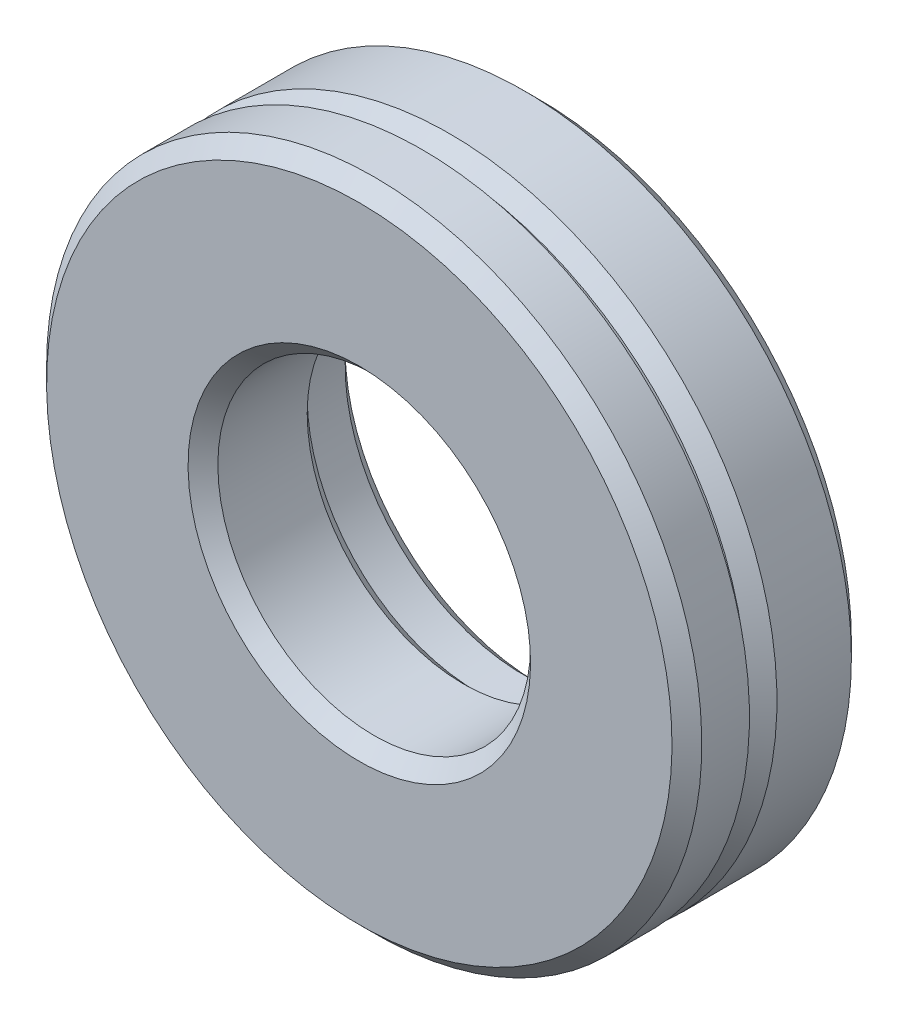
ISO-10303-21;
HEADER;
FILE_DESCRIPTION(('STEP AP214'),'2;1');
FILE_NAME('part.step','',(''),(''),'','','');
FILE_SCHEMA(('AUTOMOTIVE_DESIGN { 1 0 10303 214 1 1 1 1 }'));
ENDSEC;
DATA;
#1=APPLICATION_CONTEXT('core data for automotive mechanical design processes');
#2=APPLICATION_PROTOCOL_DEFINITION('international standard','automotive_design',2000,#1);
#3=PRODUCT_CONTEXT('',#1,'mechanical');
#4=PRODUCT('Part','Part','',(#3));
#5=PRODUCT_RELATED_PRODUCT_CATEGORY('part','',(#4));
#6=PRODUCT_DEFINITION_FORMATION('','',#4);
#7=PRODUCT_DEFINITION_CONTEXT('part definition',#1,'design');
#8=PRODUCT_DEFINITION('design','',#6,#7);
#9=PRODUCT_DEFINITION_SHAPE('','',#8);
#10=(LENGTH_UNIT() NAMED_UNIT(*) SI_UNIT(.MILLI.,.METRE.));
#11=(NAMED_UNIT(*) PLANE_ANGLE_UNIT() SI_UNIT($,.RADIAN.));
#12=(NAMED_UNIT(*) SI_UNIT($,.STERADIAN.) SOLID_ANGLE_UNIT());
#13=UNCERTAINTY_MEASURE_WITH_UNIT(LENGTH_MEASURE(1.E-05),#10,'distance_accuracy_value','');
#14=(GEOMETRIC_REPRESENTATION_CONTEXT(3) GLOBAL_UNCERTAINTY_ASSIGNED_CONTEXT((#13)) GLOBAL_UNIT_ASSIGNED_CONTEXT((#10,
#11,#12)) REPRESENTATION_CONTEXT('',''));
#15=CARTESIAN_POINT('',(0.,0.,0.));
#16=DIRECTION('',(0.,0.,1.));
#17=DIRECTION('',(1.,0.,0.));
#18=AXIS2_PLACEMENT_3D('',#15,#16,#17);
#19=CARTESIAN_POINT('',(0.,0.,0.));
#20=DIRECTION('',(0.,0.,1.));
#21=DIRECTION('',(1.,0.,0.));
#22=AXIS2_PLACEMENT_3D('',#19,#20,#21);
#23=CYLINDRICAL_SURFACE('',#22,8.61199182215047);
#24=CARTESIAN_POINT('',(0.,0.,2.90390499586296));
#25=DIRECTION('',(0.,0.,1.));
#26=DIRECTION('',(1.,0.,0.));
#27=AXIS2_PLACEMENT_3D('',#24,#25,#26);
#28=CIRCLE('',#27,8.61199182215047);
#29=CARTESIAN_POINT('',(-8.61199182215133,8.86610527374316E-13,2.90390499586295));
#30=VERTEX_POINT('',#29);
#31=EDGE_CURVE('E19',#30,#30,#28,.F.);
#32=ORIENTED_EDGE('',*,*,#31,.T.);
#33=EDGE_LOOP('',(#32));
#34=FACE_BOUND('',#33,.T.);
#35=CARTESIAN_POINT('',(0.,0.,2.90381377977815));
#36=DIRECTION('',(0.,0.,1.));
#37=DIRECTION('',(1.,0.,0.));
#38=AXIS2_PLACEMENT_3D('',#35,#36,#37);
#39=CIRCLE('',#38,8.61199182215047);
#40=CARTESIAN_POINT('',(8.61199182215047,0.,2.90381377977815));
#41=VERTEX_POINT('',#40);
#42=EDGE_CURVE('E62',#41,#41,#39,.T.);
#43=ORIENTED_EDGE('',*,*,#42,.T.);
#44=EDGE_LOOP('',(#43));
#45=FACE_BOUND('',#44,.T.);
#46=ADVANCED_FACE('F12',(#34,#45),#23,.T.);
#47=CARTESIAN_POINT('',(0.,0.,0.));
#48=DIRECTION('',(0.,0.,1.));
#49=DIRECTION('',(1.,0.,0.));
#50=AXIS2_PLACEMENT_3D('',#47,#48,#49);
#51=CYLINDRICAL_SURFACE('',#50,6.59430380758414);
#52=CARTESIAN_POINT('',(0.,0.,2.25912402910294));
#53=DIRECTION('',(0.,0.,1.));
#54=DIRECTION('',(1.,0.,0.));
#55=AXIS2_PLACEMENT_3D('',#52,#53,#54);
#56=CIRCLE('',#55,6.59430380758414);
#57=CARTESIAN_POINT('',(-6.59430380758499,8.86610527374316E-13,2.25912402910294));
#58=VERTEX_POINT('',#57);
#59=EDGE_CURVE('E32',#58,#58,#56,.F.);
#60=ORIENTED_EDGE('',*,*,#59,.F.);
#61=EDGE_LOOP('',(#60));
#62=FACE_BOUND('',#61,.T.);
#63=CARTESIAN_POINT('',(0.,0.,2.16943540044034));
#64=DIRECTION('',(0.,0.,1.));
#65=DIRECTION('',(1.,0.,0.));
#66=AXIS2_PLACEMENT_3D('',#63,#64,#65);
#67=CIRCLE('',#66,6.59430380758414);
#68=CARTESIAN_POINT('',(6.59430380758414,0.,2.16943540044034));
#69=VERTEX_POINT('',#68);
#70=EDGE_CURVE('E8',#69,#69,#67,.T.);
#71=ORIENTED_EDGE('',*,*,#70,.F.);
#72=EDGE_LOOP('',(#71));
#73=FACE_BOUND('',#72,.T.);
#74=ADVANCED_FACE('F58',(#62,#73),#51,.F.);
#75=CARTESIAN_POINT('',(-9.05098420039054E-13,8.86610527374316E-13,26.3737494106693));
#76=DIRECTION('',(0.,0.,-1.));
#77=DIRECTION('',(-1.,0.,0.));
#78=AXIS2_PLACEMENT_3D('',#75,#76,#77);
#79=SPHERICAL_SURFACE('',#78,25.);
#80=CARTESIAN_POINT('',(-9.05098420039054E-13,8.86610527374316E-13,2.04013105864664));
#81=DIRECTION('',(0.,0.,1.));
#82=DIRECTION('',(0.,1.,0.));
#83=AXIS2_PLACEMENT_3D('',#80,#81,#82);
#84=CIRCLE('',#83,5.73367403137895);
#85=CARTESIAN_POINT('',(-5.73367403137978,8.86610527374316E-13,2.04013105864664));
#86=VERTEX_POINT('',#85);
#87=EDGE_CURVE('E43',#86,#86,#84,.F.);
#88=CARTESIAN_POINT('',(-5.73367403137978,8.86610527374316E-13,2.04013105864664));
#89=CARTESIAN_POINT('',(-5.74267850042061,8.86610527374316E-13,2.04225276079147));
#90=CARTESIAN_POINT('',(-5.75168179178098,8.86610527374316E-13,2.04437946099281));
#91=CARTESIAN_POINT('',(-5.76968600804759,8.86610527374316E-13,2.04864285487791));
#92=CARTESIAN_POINT('',(-5.77868693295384,8.86610527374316E-13,2.05077954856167));
#93=CARTESIAN_POINT('',(-5.79668640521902,8.86610527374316E-13,2.05506292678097));
#94=CARTESIAN_POINT('',(-5.80568495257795,8.86610527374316E-13,2.05720961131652));
#95=CARTESIAN_POINT('',(-5.82367965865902,8.86610527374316E-13,2.06151296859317));
#96=CARTESIAN_POINT('',(-5.83267581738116,8.86610527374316E-13,2.06366964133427));
#97=CARTESIAN_POINT('',(-5.85066573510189,8.86610527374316E-13,2.06799297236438));
#98=CARTESIAN_POINT('',(-5.85965949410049,8.86610527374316E-13,2.07015963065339));
#99=CARTESIAN_POINT('',(-5.8776446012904,8.86610527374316E-13,2.0745029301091));
#100=CARTESIAN_POINT('',(-5.88663594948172,8.86610527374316E-13,2.0766795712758));
#101=CARTESIAN_POINT('',(-5.9046162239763,8.86610527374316E-13,2.08104283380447));
#102=CARTESIAN_POINT('',(-5.91360515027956,8.86610527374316E-13,2.08322945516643));
#103=CARTESIAN_POINT('',(-5.93158056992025,8.86610527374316E-13,2.08761267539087));
#104=CARTESIAN_POINT('',(-5.94056706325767,8.86610527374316E-13,2.08980927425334));
#105=CARTESIAN_POINT('',(-5.95853760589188,8.86610527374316E-13,2.09421244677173));
#106=CARTESIAN_POINT('',(-5.96752165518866,8.86610527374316E-13,2.09641902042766));
#107=CARTESIAN_POINT('',(-5.98548729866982,8.86610527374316E-13,2.10084213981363));
#108=CARTESIAN_POINT('',(-5.9944688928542,8.86610527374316E-13,2.10305868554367));
#109=CARTESIAN_POINT('',(-6.01242961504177,8.86610527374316E-13,2.10750174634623));
#110=CARTESIAN_POINT('',(-6.02140874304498,8.86610527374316E-13,2.10972826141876));
#111=CARTESIAN_POINT('',(-6.0393645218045,8.86610527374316E-13,2.11419125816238));
#112=CARTESIAN_POINT('',(-6.04834117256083,8.86610527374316E-13,2.11642773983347));
#113=CARTESIAN_POINT('',(-6.06629198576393,8.86610527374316E-13,2.12091066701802));
#114=CARTESIAN_POINT('',(-6.0752661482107,8.86610527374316E-13,2.12315711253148));
#115=CARTESIAN_POINT('',(-6.09321197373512,8.86610527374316E-13,2.12765996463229));
#116=CARTESIAN_POINT('',(-6.10218363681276,8.86610527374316E-13,2.12991637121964));
#117=CARTESIAN_POINT('',(-6.12012445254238,8.86610527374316E-13,2.13443914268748));
#118=CARTESIAN_POINT('',(-6.12909360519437,8.86610527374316E-13,2.13670550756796));
#119=CARTESIAN_POINT('',(-6.14702938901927,8.86610527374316E-13,2.14124819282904));
#120=CARTESIAN_POINT('',(-6.15599602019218,8.86610527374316E-13,2.14352451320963));
#121=CARTESIAN_POINT('',(-6.17392675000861,8.86610527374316E-13,2.14808710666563));
#122=CARTESIAN_POINT('',(-6.18289084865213,8.86610527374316E-13,2.15037337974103));
#123=CARTESIAN_POINT('',(-6.20081650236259,8.86610527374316E-13,2.15495587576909));
#124=CARTESIAN_POINT('',(-6.20977805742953,8.86610527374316E-13,2.15725209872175));
#125=CARTESIAN_POINT('',(-6.22769861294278,8.86610527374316E-13,2.16185449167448));
#126=CARTESIAN_POINT('',(-6.23665761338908,8.86610527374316E-13,2.16416066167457));
#127=CARTESIAN_POINT('',(-6.25457304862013,8.86610527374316E-13,2.16878294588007));
#128=CARTESIAN_POINT('',(-6.26352948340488,8.86610527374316E-13,2.1710990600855));
#129=CARTESIAN_POINT('',(-6.28143977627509,8.86610527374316E-13,2.17574122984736));
#130=CARTESIAN_POINT('',(-6.29039363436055,8.86610527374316E-13,2.17806728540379));
#131=CARTESIAN_POINT('',(-6.30829876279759,8.86610527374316E-13,2.18272933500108));
#132=CARTESIAN_POINT('',(-6.31725003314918,8.86610527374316E-13,2.18506532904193));
#133=CARTESIAN_POINT('',(-6.3351499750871,8.86610527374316E-13,2.18974725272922));
#134=CARTESIAN_POINT('',(-6.34409864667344,8.86610527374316E-13,2.19209318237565));
#135=CARTESIAN_POINT('',(-6.36199338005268,8.86610527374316E-13,2.19679497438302));
#136=CARTESIAN_POINT('',(-6.37093944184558,8.86610527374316E-13,2.19915083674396));
#137=CARTESIAN_POINT('',(-6.38882894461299,8.86610527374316E-13,2.20387249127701));
#138=CARTESIAN_POINT('',(-6.3977723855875,8.86610527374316E-13,2.20623828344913));
#139=CARTESIAN_POINT('',(-6.41565663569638,8.86610527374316E-13,2.21097979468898));
#140=CARTESIAN_POINT('',(-6.42459744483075,8.86610527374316E-13,2.21335551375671));
#141=CARTESIAN_POINT('',(-6.44247642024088,8.86610527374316E-13,2.21811687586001));
#142=CARTESIAN_POINT('',(-6.45141458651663,8.86610527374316E-13,2.22050251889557));
#143=CARTESIAN_POINT('',(-6.46928826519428,8.86610527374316E-13,2.22528372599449));
#144=CARTESIAN_POINT('',(-6.47822377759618,8.86610527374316E-13,2.22767929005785));
#145=CARTESIAN_POINT('',(-6.49609213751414,8.86610527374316E-13,2.23248033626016));
#146=CARTESIAN_POINT('',(-6.50502498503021,8.86610527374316E-13,2.23488581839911));
#147=CARTESIAN_POINT('',(-6.52288800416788,8.86610527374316E-13,2.23970669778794));
#148=CARTESIAN_POINT('',(-6.53181817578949,8.86610527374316E-13,2.24212209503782));
#149=CARTESIAN_POINT('',(-6.54967583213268,8.86610527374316E-13,2.24696280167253));
#150=CARTESIAN_POINT('',(-6.55860331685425,8.86610527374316E-13,2.24938811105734));
#151=CARTESIAN_POINT('',(-6.57645558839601,8.86610527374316E-13,2.25424863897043));
#152=CARTESIAN_POINT('',(-6.5853803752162,8.86610527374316E-13,2.2566838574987));
#153=CARTESIAN_POINT('',(-6.59430380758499,8.86610527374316E-13,2.25912402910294));
#154=B_SPLINE_CURVE_WITH_KNOTS('',3,(#88,#89,#90,#91,#92,#93,#94,#95,#96,#97,#98,#99,#100,#101,
#102,#103,#104,#105,#106,#107,#108,#109,#110,#111,#112,#113,#114,#115,#116,#117,#118,#119,#120,
#121,#122,#123,#124,#125,#126,#127,#128,#129,#130,#131,#132,#133,#134,#135,#136,#137,#138,#139,
#140,#141,#142,#143,#144,#145,#146,#147,#148,#149,#150,#151,#152,#153),.UNSPECIFIED.,.F.,.F.,(4,
2,2,2,2,2,2,2,2,2,2,2,2,2,2,2,2,2,2,2,2,2,2,2,2,2,2,2,2,2,2,2,4),(0.,0.0277531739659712,
0.0555063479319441,0.0832595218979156,0.111012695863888,0.138765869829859,0.166519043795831,
0.194272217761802,0.222025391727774,0.249778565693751,0.277531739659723,0.305284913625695,
0.333038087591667,0.360791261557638,0.38854443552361,0.416297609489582,0.444050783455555,
0.471803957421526,0.499557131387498,0.527310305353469,0.55506347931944,0.582816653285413,
0.610569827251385,0.638323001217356,0.666076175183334,0.693829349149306,0.721582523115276,
0.749335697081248,0.77708887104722,0.804842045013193,0.832595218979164,0.860348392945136,
0.888101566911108),.UNSPECIFIED.);
#155=EDGE_CURVE('BSEAM54',#86,#58,#154,.T.);
#156=ORIENTED_EDGE('',*,*,#87,.F.);
#157=ORIENTED_EDGE('',*,*,#59,.T.);
#158=ORIENTED_EDGE('',*,*,#155,.T.);
#159=ORIENTED_EDGE('',*,*,#155,.F.);
#160=EDGE_LOOP('',(#156,#158,#157,#159));
#161=FACE_BOUND('',#160,.T.);
#162=ADVANCED_FACE('F54',(#161),#79,.T.);
#163=CARTESIAN_POINT('',(-9.05098420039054E-13,8.86610527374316E-13,3.92380509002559));
#164=DIRECTION('',(0.,0.,-1.));
#165=DIRECTION('',(0.,-1.,0.));
#166=AXIS2_PLACEMENT_3D('',#163,#164,#165);
#167=CIRCLE('',#166,11.);
#168=CARTESIAN_POINT('',(-11.0000000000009,8.86610527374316E-13,3.92380509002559));
#169=VERTEX_POINT('',#168);
#170=EDGE_CURVE('E44',#169,#169,#167,.T.);
#171=CARTESIAN_POINT('',(-8.61199182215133,8.86610527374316E-13,2.90390499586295));
#172=CARTESIAN_POINT('',(-8.63739650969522,8.86610527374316E-13,2.91322695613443));
#173=CARTESIAN_POINT('',(-8.66278606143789,8.86610527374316E-13,2.92259016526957));
#174=CARTESIAN_POINT('',(-8.71353462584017,8.86610527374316E-13,2.94139898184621));
#175=CARTESIAN_POINT('',(-8.73889363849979,8.86610527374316E-13,2.9508445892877));
#176=CARTESIAN_POINT('',(-8.78958085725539,8.86610527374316E-13,2.96981810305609));
#177=CARTESIAN_POINT('',(-8.81490906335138,8.86610527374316E-13,2.97934600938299));
#178=CARTESIAN_POINT('',(-8.86553440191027,8.86610527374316E-13,2.99848402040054));
#179=CARTESIAN_POINT('',(-8.89083153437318,8.86610527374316E-13,3.0080941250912));
#180=CARTESIAN_POINT('',(-8.94139445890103,8.86610527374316E-13,3.02739643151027));
#181=CARTESIAN_POINT('',(-8.96666025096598,8.86610527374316E-13,3.03708863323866));
#182=CARTESIAN_POINT('',(-9.01716022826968,8.86610527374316E-13,3.05655503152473));
#183=CARTESIAN_POINT('',(-9.04239441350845,8.86610527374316E-13,3.06632922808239));
#184=CARTESIAN_POINT('',(-9.09283091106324,8.86610527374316E-13,3.08595951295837));
#185=CARTESIAN_POINT('',(-9.11803322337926,8.86610527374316E-13,3.09581560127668));
#186=CARTESIAN_POINT('',(-9.16840570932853,8.86610527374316E-13,3.11560956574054));
#187=CARTESIAN_POINT('',(-9.19357588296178,8.86610527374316E-13,3.12554744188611));
#188=CARTESIAN_POINT('',(-9.24388382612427,8.86610527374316E-13,3.14550487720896));
#189=CARTESIAN_POINT('',(-9.26902159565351,8.86610527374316E-13,3.15552443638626));
#190=CARTESIAN_POINT('',(-9.31926446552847,8.86610527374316E-13,3.17564513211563));
#191=CARTESIAN_POINT('',(-9.3443695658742,8.86610527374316E-13,3.18574626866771));
#192=CARTESIAN_POINT('',(-9.39454683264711,8.86610527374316E-13,3.20603001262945));
#193=CARTESIAN_POINT('',(-9.41961899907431,8.86610527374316E-13,3.21621262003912));
#194=CARTESIAN_POINT('',(-9.46973013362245,8.86610527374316E-13,3.23665919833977));
#195=CARTESIAN_POINT('',(-9.49476910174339,8.86610527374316E-13,3.24692316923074));
#196=CARTESIAN_POINT('',(-9.54481357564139,8.86610527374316E-13,3.26753236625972));
#197=CARTESIAN_POINT('',(-9.56981908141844,8.86610527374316E-13,3.27787759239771));
#198=CARTESIAN_POINT('',(-9.61979636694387,8.86610527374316E-13,3.29864919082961));
#199=CARTESIAN_POINT('',(-9.64476814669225,8.86610527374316E-13,3.30907556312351));
#200=CARTESIAN_POINT('',(-9.69467771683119,8.86610527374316E-13,3.33000934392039));
#201=CARTESIAN_POINT('',(-9.71961550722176,8.86610527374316E-13,3.34051675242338));
#202=CARTESIAN_POINT('',(-9.76945683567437,8.86610527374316E-13,3.36161249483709));
#203=CARTESIAN_POINT('',(-9.79436037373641,8.86610527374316E-13,3.37220082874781));
#204=CARTESIAN_POINT('',(-9.84413293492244,8.86610527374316E-13,3.39345831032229));
#205=CARTESIAN_POINT('',(-9.86900195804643,8.86610527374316E-13,3.40412745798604));
#206=CARTESIAN_POINT('',(-9.91870522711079,8.86610527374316E-13,3.42554645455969));
#207=CARTESIAN_POINT('',(-9.94353947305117,8.86610527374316E-13,3.43629630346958));
#208=CARTESIAN_POINT('',(-9.99317292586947,8.86610527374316E-13,3.45787658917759));
#209=CARTESIAN_POINT('',(-10.0179721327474,8.86610527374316E-13,3.46870702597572));
#210=CARTESIAN_POINT('',(-10.0675352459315,8.86610527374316E-13,3.4904483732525));
#211=CARTESIAN_POINT('',(-10.0922991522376,8.86610527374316E-13,3.50135928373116));
#212=CARTESIAN_POINT('',(-10.141791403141,8.86610527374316E-13,3.52326146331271));
#213=CARTESIAN_POINT('',(-10.1665197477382,8.86610527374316E-13,3.5342527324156));
#214=CARTESIAN_POINT('',(-10.2159406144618,8.86610527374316E-13,3.55631551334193));
#215=CARTESIAN_POINT('',(-10.240633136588,8.86610527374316E-13,3.56738702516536));
#216=CARTESIAN_POINT('',(-10.2899820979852,8.86610527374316E-13,3.58961017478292));
#217=CARTESIAN_POINT('',(-10.3146385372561,8.86610527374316E-13,3.60076181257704));
#218=CARTESIAN_POINT('',(-10.3639150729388,8.86610527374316E-13,3.62314509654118));
#219=CARTESIAN_POINT('',(-10.3885351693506,8.86610527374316E-13,3.6343767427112));
#220=CARTESIAN_POINT('',(-10.4377387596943,8.86610527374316E-13,3.65691992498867));
#221=CARTESIAN_POINT('',(-10.4623222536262,8.86610527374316E-13,3.66823146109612));
#222=CARTESIAN_POINT('',(-10.5114523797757,8.86610527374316E-13,3.69093430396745));
#223=CARTESIAN_POINT('',(-10.5359990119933,8.86610527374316E-13,3.70232561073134));
#224=CARTESIAN_POINT('',(-10.5850551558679,8.86610527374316E-13,3.72518787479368));
#225=CARTESIAN_POINT('',(-10.609564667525,8.86610527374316E-13,3.73665883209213));
#226=CARTESIAN_POINT('',(-10.6585463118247,8.86610527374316E-13,3.75968027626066));
#227=CARTESIAN_POINT('',(-10.6830184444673,8.86610527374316E-13,3.77123076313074));
#228=CARTESIAN_POINT('',(-10.7319250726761,8.86610527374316E-13,3.79441114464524));
#229=CARTESIAN_POINT('',(-10.7563595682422,8.86610527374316E-13,3.80604103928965));
#230=CARTESIAN_POINT('',(-10.8051906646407,8.86610527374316E-13,3.82938011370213));
#231=CARTESIAN_POINT('',(-10.8295872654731,8.86610527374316E-13,3.84108929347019));
#232=CARTESIAN_POINT('',(-10.8783423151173,8.86610527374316E-13,3.86458681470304));
#233=CARTESIAN_POINT('',(-10.9027007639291,8.86610527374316E-13,3.87637515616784));
#234=CARTESIAN_POINT('',(-10.9513792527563,8.86610527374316E-13,3.90003087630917));
#235=CARTESIAN_POINT('',(-10.9756992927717,8.86610527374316E-13,3.9118982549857));
#236=CARTESIAN_POINT('',(-11.0000000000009,8.86610527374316E-13,3.92380509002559));
#237=B_SPLINE_CURVE_WITH_KNOTS('',3,(#171,#172,#173,#174,#175,#176,#177,#178,#179,#180,#181,
#182,#183,#184,#185,#186,#187,#188,#189,#190,#191,#192,#193,#194,#195,#196,#197,#198,#199,#200,
#201,#202,#203,#204,#205,#206,#207,#208,#209,#210,#211,#212,#213,#214,#215,#216,#217,#218,#219,
#220,#221,#222,#223,#224,#225,#226,#227,#228,#229,#230,#231,#232,#233,#234,#235,#236),
.UNSPECIFIED.,.F.,.F.,(4,2,2,2,2,2,2,2,2,2,2,2,2,2,2,2,2,2,2,2,2,2,2,2,2,2,2,2,2,2,2,2,4),(0.,
0.081182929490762,0.162365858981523,0.243548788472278,0.324731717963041,0.405914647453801,
0.487097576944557,0.568280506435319,0.649463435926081,0.730646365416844,0.811829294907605,
0.893012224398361,0.974195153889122,1.05537808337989,1.13656101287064,1.2177439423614,
1.29892687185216,1.38010980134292,1.46129273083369,1.54247566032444,1.62365858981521,
1.70484151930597,1.78602444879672,1.86720737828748,1.94839030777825,2.02957323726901,
2.11075616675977,2.19193909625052,2.27312202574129,2.35430495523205,2.4354878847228,
2.51667081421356,2.59785374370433),.UNSPECIFIED.);
#238=EDGE_CURVE('BSEAM57',#30,#169,#237,.T.);
#239=ORIENTED_EDGE('',*,*,#31,.F.);
#240=ORIENTED_EDGE('',*,*,#170,.T.);
#241=ORIENTED_EDGE('',*,*,#238,.T.);
#242=ORIENTED_EDGE('',*,*,#238,.F.);
#243=EDGE_LOOP('',(#239,#241,#240,#242));
#244=FACE_BOUND('',#243,.T.);
#245=ADVANCED_FACE('F57',(#244),#79,.T.);
#246=CARTESIAN_POINT('',(-9.05098420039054E-13,8.86610527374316E-13,2.02380509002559));
#247=DIRECTION('',(0.,0.,-1.));
#248=DIRECTION('',(0.,-1.,0.));
#249=AXIS2_PLACEMENT_3D('',#246,#247,#248);
#250=CYLINDRICAL_SURFACE('',#249,11.);
#251=CARTESIAN_POINT('',(-9.05098420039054E-13,8.86610527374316E-13,5.52380509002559));
#252=DIRECTION('',(0.,0.,1.));
#253=DIRECTION('',(0.,1.,0.));
#254=AXIS2_PLACEMENT_3D('',#251,#252,#253);
#255=CIRCLE('',#254,11.);
#256=CARTESIAN_POINT('',(-9.05098420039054E-13,11.0000000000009,5.52380509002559));
#257=VERTEX_POINT('',#256);
#258=EDGE_CURVE('E28',#257,#257,#255,.F.);
#259=ORIENTED_EDGE('',*,*,#258,.T.);
#260=EDGE_LOOP('',(#259));
#261=FACE_BOUND('',#260,.T.);
#262=ORIENTED_EDGE('',*,*,#170,.F.);
#263=EDGE_LOOP('',(#262));
#264=FACE_BOUND('',#263,.T.);
#265=ADVANCED_FACE('F141',(#261,#264),#250,.T.);
#266=CARTESIAN_POINT('',(-9.05098420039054E-13,8.86610527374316E-13,6.02380509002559));
#267=DIRECTION('',(0.,0.,1.));
#268=DIRECTION('',(0.,1.,0.));
#269=AXIS2_PLACEMENT_3D('',#266,#267,#268);
#270=PLANE('',#269);
#271=CARTESIAN_POINT('',(-9.05098420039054E-13,8.86610527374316E-13,6.02380509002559));
#272=DIRECTION('',(0.,0.,1.));
#273=DIRECTION('',(0.,1.,0.));
#274=AXIS2_PLACEMENT_3D('',#271,#272,#273);
#275=CIRCLE('',#274,10.5);
#276=CARTESIAN_POINT('',(-9.05098420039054E-13,10.5000000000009,6.02380509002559));
#277=VERTEX_POINT('',#276);
#278=EDGE_CURVE('E23',#277,#277,#275,.T.);
#279=ORIENTED_EDGE('',*,*,#278,.T.);
#280=EDGE_LOOP('',(#279));
#281=FACE_BOUND('',#280,.T.);
#282=CARTESIAN_POINT('',(-9.05098420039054E-13,8.86610527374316E-13,6.02380509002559));
#283=DIRECTION('',(0.,0.,1.));
#284=DIRECTION('',(0.,1.,0.));
#285=AXIS2_PLACEMENT_3D('',#282,#283,#284);
#286=CIRCLE('',#285,5.75);
#287=CARTESIAN_POINT('',(-9.05098420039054E-13,5.75000000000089,6.02380509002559));
#288=VERTEX_POINT('',#287);
#289=EDGE_CURVE('E34',#288,#288,#286,.T.);
#290=ORIENTED_EDGE('',*,*,#289,.F.);
#291=EDGE_LOOP('',(#290));
#292=FACE_BOUND('',#291,.T.);
#293=ADVANCED_FACE('F138',(#281,#292),#270,.T.);
#294=CARTESIAN_POINT('',(-9.05098420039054E-13,8.86610527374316E-13,5.52380509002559));
#295=DIRECTION('',(0.,0.,-1.));
#296=DIRECTION('',(0.,-1.,0.));
#297=AXIS2_PLACEMENT_3D('',#294,#295,#296);
#298=CONICAL_SURFACE('',#297,11.,0.78539816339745);
#299=ORIENTED_EDGE('',*,*,#278,.F.);
#300=EDGE_LOOP('',(#299));
#301=FACE_BOUND('',#300,.T.);
#302=ORIENTED_EDGE('',*,*,#258,.F.);
#303=EDGE_LOOP('',(#302));
#304=FACE_BOUND('',#303,.T.);
#305=ADVANCED_FACE('F14',(#301,#304),#298,.T.);
#306=CARTESIAN_POINT('',(-9.05098420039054E-13,8.86610527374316E-13,2.52380509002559));
#307=DIRECTION('',(0.,0.,-1.));
#308=DIRECTION('',(0.,-1.,0.));
#309=AXIS2_PLACEMENT_3D('',#306,#307,#308);
#310=CONICAL_SURFACE('',#309,5.25,0.785398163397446);
#311=ORIENTED_EDGE('',*,*,#87,.T.);
#312=EDGE_LOOP('',(#311));
#313=FACE_BOUND('',#312,.T.);
#314=CARTESIAN_POINT('',(-9.05098420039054E-13,8.86610527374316E-13,2.52380509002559));
#315=DIRECTION('',(0.,0.,1.));
#316=DIRECTION('',(0.,1.,0.));
#317=AXIS2_PLACEMENT_3D('',#314,#315,#316);
#318=CIRCLE('',#317,5.25);
#319=CARTESIAN_POINT('',(-9.05098420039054E-13,5.25000000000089,2.52380509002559));
#320=VERTEX_POINT('',#319);
#321=EDGE_CURVE('E40',#320,#320,#318,.T.);
#322=ORIENTED_EDGE('',*,*,#321,.T.);
#323=EDGE_LOOP('',(#322));
#324=FACE_BOUND('',#323,.T.);
#325=ADVANCED_FACE('F51',(#313,#324),#310,.F.);
#326=CARTESIAN_POINT('',(-9.05098420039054E-13,8.86610527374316E-13,6.02380509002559));
#327=DIRECTION('',(0.,0.,1.));
#328=DIRECTION('',(0.,1.,0.));
#329=AXIS2_PLACEMENT_3D('',#326,#327,#328);
#330=CYLINDRICAL_SURFACE('',#329,5.25);
#331=ORIENTED_EDGE('',*,*,#321,.F.);
#332=EDGE_LOOP('',(#331));
#333=FACE_BOUND('',#332,.T.);
#334=CARTESIAN_POINT('',(-9.05098420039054E-13,8.86610527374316E-13,5.52380509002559));
#335=DIRECTION('',(0.,0.,1.));
#336=DIRECTION('',(0.,1.,0.));
#337=AXIS2_PLACEMENT_3D('',#334,#335,#336);
#338=CIRCLE('',#337,5.25);
#339=CARTESIAN_POINT('',(-9.05098420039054E-13,5.25000000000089,5.52380509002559));
#340=VERTEX_POINT('',#339);
#341=EDGE_CURVE('E37',#340,#340,#338,.T.);
#342=ORIENTED_EDGE('',*,*,#341,.T.);
#343=EDGE_LOOP('',(#342));
#344=FACE_BOUND('',#343,.T.);
#345=ADVANCED_FACE('F131',(#333,#344),#330,.F.);
#346=CARTESIAN_POINT('',(-9.05098420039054E-13,8.86610527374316E-13,6.02380509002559));
#347=DIRECTION('',(0.,0.,1.));
#348=DIRECTION('',(0.,1.,0.));
#349=AXIS2_PLACEMENT_3D('',#346,#347,#348);
#350=CONICAL_SURFACE('',#349,5.75,0.785398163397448);
#351=ORIENTED_EDGE('',*,*,#341,.F.);
#352=EDGE_LOOP('',(#351));
#353=FACE_BOUND('',#352,.T.);
#354=ORIENTED_EDGE('',*,*,#289,.T.);
#355=EDGE_LOOP('',(#354));
#356=FACE_BOUND('',#355,.T.);
#357=ADVANCED_FACE('F127',(#353,#356),#350,.F.);
#358=CARTESIAN_POINT('',(0.,0.,0.5));
#359=DIRECTION('',(0.,0.,-1.));
#360=DIRECTION('',(0.,-1.,0.));
#361=AXIS2_PLACEMENT_3D('',#358,#359,#360);
#362=CONICAL_SURFACE('',#361,6.,0.785398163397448);
#363=CARTESIAN_POINT('',(0.,0.,0.));
#364=DIRECTION('',(0.,0.,1.));
#365=DIRECTION('',(0.,1.,0.));
#366=AXIS2_PLACEMENT_3D('',#363,#364,#365);
#367=CIRCLE('',#366,6.5);
#368=CARTESIAN_POINT('',(0.,6.5,0.));
#369=VERTEX_POINT('',#368);
#370=EDGE_CURVE('E78',#369,#369,#367,.T.);
#371=ORIENTED_EDGE('',*,*,#370,.F.);
#372=EDGE_LOOP('',(#371));
#373=FACE_BOUND('',#372,.T.);
#374=CARTESIAN_POINT('',(0.,0.,0.5));
#375=DIRECTION('',(0.,0.,1.));
#376=DIRECTION('',(0.,1.,0.));
#377=AXIS2_PLACEMENT_3D('',#374,#375,#376);
#378=CIRCLE('',#377,6.);
#379=CARTESIAN_POINT('',(0.,6.,0.5));
#380=VERTEX_POINT('',#379);
#381=EDGE_CURVE('E68',#380,#380,#378,.T.);
#382=ORIENTED_EDGE('',*,*,#381,.T.);
#383=EDGE_LOOP('',(#382));
#384=FACE_BOUND('',#383,.T.);
#385=ADVANCED_FACE('F130',(#373,#384),#362,.F.);
#386=CARTESIAN_POINT('',(0.,0.,3.5));
#387=DIRECTION('',(0.,0.,1.));
#388=DIRECTION('',(0.,1.,0.));
#389=AXIS2_PLACEMENT_3D('',#386,#387,#388);
#390=CYLINDRICAL_SURFACE('',#389,6.);
#391=ORIENTED_EDGE('',*,*,#381,.F.);
#392=EDGE_LOOP('',(#391));
#393=FACE_BOUND('',#392,.T.);
#394=CARTESIAN_POINT('',(0.,0.,1.95312650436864));
#395=DIRECTION('',(0.,0.,1.));
#396=DIRECTION('',(0.,1.,0.));
#397=AXIS2_PLACEMENT_3D('',#394,#395,#396);
#398=CIRCLE('',#397,6.);
#399=CARTESIAN_POINT('',(0.,6.,1.95312650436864));
#400=VERTEX_POINT('',#399);
#401=EDGE_CURVE('E64',#400,#400,#398,.T.);
#402=ORIENTED_EDGE('',*,*,#401,.T.);
#403=EDGE_LOOP('',(#402));
#404=FACE_BOUND('',#403,.T.);
#405=ADVANCED_FACE('F199',(#393,#404),#390,.F.);
#406=CARTESIAN_POINT('',(0.,0.,3.5));
#407=DIRECTION('',(0.,0.,1.));
#408=DIRECTION('',(0.,1.,0.));
#409=AXIS2_PLACEMENT_3D('',#406,#407,#408);
#410=CONICAL_SURFACE('',#409,10.25,1.22173047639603);
#411=ORIENTED_EDGE('',*,*,#401,.F.);
#412=EDGE_LOOP('',(#411));
#413=FACE_BOUND('',#412,.T.);
#414=ORIENTED_EDGE('',*,*,#70,.T.);
#415=EDGE_LOOP('',(#414));
#416=FACE_BOUND('',#415,.T.);
#417=ADVANCED_FACE('F207',(#413,#416),#410,.F.);
#418=ORIENTED_EDGE('',*,*,#42,.F.);
#419=EDGE_LOOP('',(#418));
#420=FACE_BOUND('',#419,.T.);
#421=CARTESIAN_POINT('',(0.,0.,3.5));
#422=DIRECTION('',(0.,0.,1.));
#423=DIRECTION('',(0.,1.,0.));
#424=AXIS2_PLACEMENT_3D('',#421,#422,#423);
#425=CIRCLE('',#424,10.25);
#426=CARTESIAN_POINT('',(0.,10.25,3.5));
#427=VERTEX_POINT('',#426);
#428=EDGE_CURVE('E71',#427,#427,#425,.T.);
#429=ORIENTED_EDGE('',*,*,#428,.T.);
#430=EDGE_LOOP('',(#429));
#431=FACE_BOUND('',#430,.T.);
#432=ADVANCED_FACE('F114',(#420,#431),#410,.F.);
#433=CARTESIAN_POINT('',(0.,0.,3.5));
#434=DIRECTION('',(0.,0.,-1.));
#435=DIRECTION('',(-1.,0.,0.));
#436=AXIS2_PLACEMENT_3D('',#433,#434,#435);
#437=PLANE('',#436);
#438=ORIENTED_EDGE('',*,*,#428,.F.);
#439=EDGE_LOOP('',(#438));
#440=FACE_BOUND('',#439,.T.);
#441=CARTESIAN_POINT('',(0.,0.,3.5));
#442=DIRECTION('',(0.,0.,-1.));
#443=DIRECTION('',(-1.,0.,0.));
#444=AXIS2_PLACEMENT_3D('',#441,#442,#443);
#445=CIRCLE('',#444,10.5);
#446=CARTESIAN_POINT('',(-10.5,0.,3.5));
#447=VERTEX_POINT('',#446);
#448=EDGE_CURVE('E73',#447,#447,#445,.F.);
#449=ORIENTED_EDGE('',*,*,#448,.T.);
#450=EDGE_LOOP('',(#449));
#451=FACE_BOUND('',#450,.T.);
#452=ADVANCED_FACE('F92',(#440,#451),#437,.F.);
#453=CARTESIAN_POINT('',(0.,0.,0.));
#454=DIRECTION('',(0.,0.,-1.));
#455=DIRECTION('',(-1.,0.,0.));
#456=AXIS2_PLACEMENT_3D('',#453,#454,#455);
#457=CYLINDRICAL_SURFACE('',#456,11.);
#458=CARTESIAN_POINT('',(0.,0.,0.5));
#459=DIRECTION('',(0.,0.,1.));
#460=DIRECTION('',(1.,0.,0.));
#461=AXIS2_PLACEMENT_3D('',#458,#459,#460);
#462=CIRCLE('',#461,11.);
#463=CARTESIAN_POINT('',(11.,0.,0.5));
#464=VERTEX_POINT('',#463);
#465=EDGE_CURVE('E86',#464,#464,#462,.T.);
#466=ORIENTED_EDGE('',*,*,#465,.T.);
#467=EDGE_LOOP('',(#466));
#468=FACE_BOUND('',#467,.T.);
#469=CARTESIAN_POINT('',(0.,0.,3.));
#470=DIRECTION('',(0.,0.,-1.));
#471=DIRECTION('',(-1.,0.,0.));
#472=AXIS2_PLACEMENT_3D('',#469,#470,#471);
#473=CIRCLE('',#472,11.);
#474=CARTESIAN_POINT('',(-11.,0.,3.));
#475=VERTEX_POINT('',#474);
#476=EDGE_CURVE('E81',#475,#475,#473,.T.);
#477=ORIENTED_EDGE('',*,*,#476,.T.);
#478=EDGE_LOOP('',(#477));
#479=FACE_BOUND('',#478,.T.);
#480=ADVANCED_FACE('F102',(#468,#479),#457,.T.);
#481=CARTESIAN_POINT('',(0.,0.,0.));
#482=DIRECTION('',(0.,0.,1.));
#483=DIRECTION('',(1.,0.,0.));
#484=AXIS2_PLACEMENT_3D('',#481,#482,#483);
#485=CONICAL_SURFACE('',#484,10.5,0.78539816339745);
#486=ORIENTED_EDGE('',*,*,#465,.F.);
#487=EDGE_LOOP('',(#486));
#488=FACE_BOUND('',#487,.T.);
#489=CARTESIAN_POINT('',(0.,0.,0.));
#490=DIRECTION('',(0.,0.,1.));
#491=DIRECTION('',(1.,0.,0.));
#492=AXIS2_PLACEMENT_3D('',#489,#490,#491);
#493=CIRCLE('',#492,10.5);
#494=CARTESIAN_POINT('',(10.5,0.,0.));
#495=VERTEX_POINT('',#494);
#496=EDGE_CURVE('E77',#495,#495,#493,.F.);
#497=ORIENTED_EDGE('',*,*,#496,.F.);
#498=EDGE_LOOP('',(#497));
#499=FACE_BOUND('',#498,.T.);
#500=ADVANCED_FACE('F98',(#488,#499),#485,.T.);
#501=CARTESIAN_POINT('',(0.,0.,3.));
#502=DIRECTION('',(0.,0.,-1.));
#503=DIRECTION('',(-1.,0.,0.));
#504=AXIS2_PLACEMENT_3D('',#501,#502,#503);
#505=CONICAL_SURFACE('',#504,11.,0.78539816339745);
#506=ORIENTED_EDGE('',*,*,#448,.F.);
#507=EDGE_LOOP('',(#506));
#508=FACE_BOUND('',#507,.T.);
#509=ORIENTED_EDGE('',*,*,#476,.F.);
#510=EDGE_LOOP('',(#509));
#511=FACE_BOUND('',#510,.T.);
#512=ADVANCED_FACE('F94',(#508,#511),#505,.T.);
#513=CARTESIAN_POINT('',(0.,0.,0.));
#514=DIRECTION('',(0.,0.,1.));
#515=DIRECTION('',(1.,0.,0.));
#516=AXIS2_PLACEMENT_3D('',#513,#514,#515);
#517=PLANE('',#516);
#518=ORIENTED_EDGE('',*,*,#370,.T.);
#519=EDGE_LOOP('',(#518));
#520=FACE_BOUND('',#519,.T.);
#521=ORIENTED_EDGE('',*,*,#496,.T.);
#522=EDGE_LOOP('',(#521));
#523=FACE_BOUND('',#522,.T.);
#524=ADVANCED_FACE('F97',(#520,#523),#517,.F.);
#525=CLOSED_SHELL('',(#46,#74,#162,#245,#265,#293,#305,#325,#345,#357,#385,#405,#417,#432,#452,
#480,#500,#512,#524));
#526=MANIFOLD_SOLID_BREP('B1',#525);
#527=ADVANCED_BREP_SHAPE_REPRESENTATION('',(#18,#526),#14);
#528=SHAPE_DEFINITION_REPRESENTATION(#9,#527);
ENDSEC;
END-ISO-10303-21;
